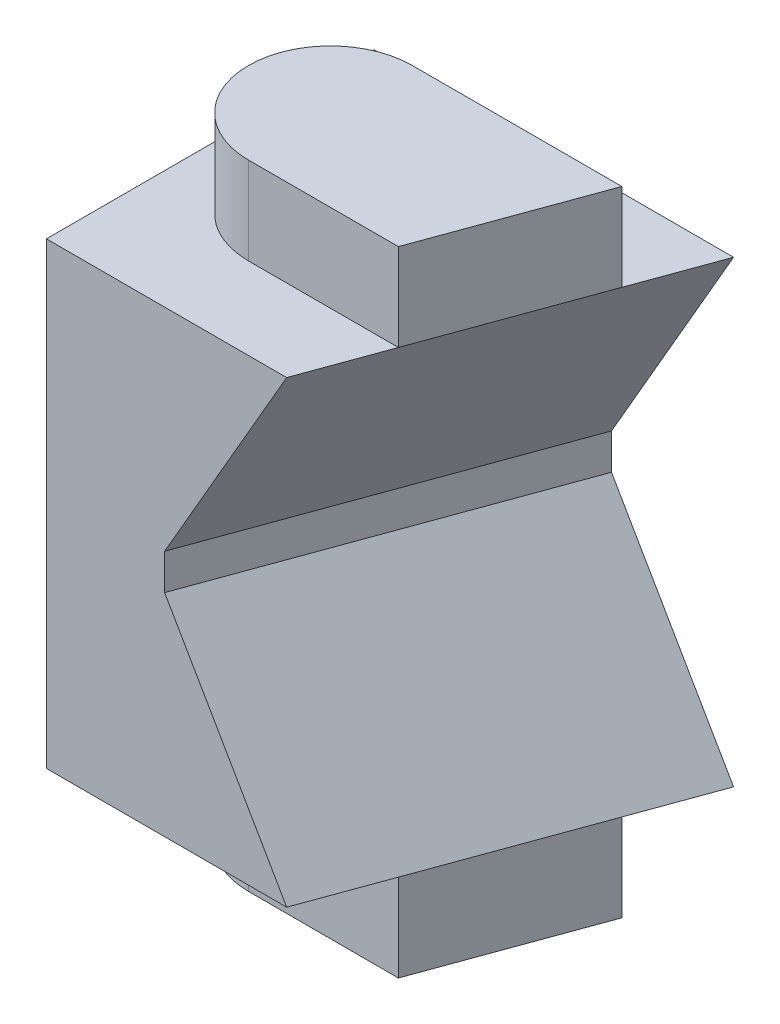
ISO-10303-21;
HEADER;
FILE_DESCRIPTION(('STEP AP214'),'2;1');
FILE_NAME('part.step','',(''),(''),'','','');
FILE_SCHEMA(('AUTOMOTIVE_DESIGN { 1 0 10303 214 1 1 1 1 }'));
ENDSEC;
DATA;
#1=APPLICATION_CONTEXT('core data for automotive mechanical design processes');
#2=APPLICATION_PROTOCOL_DEFINITION('international standard','automotive_design',2000,#1);
#3=PRODUCT_CONTEXT('',#1,'mechanical');
#4=PRODUCT('Part','Part','',(#3));
#5=PRODUCT_RELATED_PRODUCT_CATEGORY('part','',(#4));
#6=PRODUCT_DEFINITION_FORMATION('','',#4);
#7=PRODUCT_DEFINITION_CONTEXT('part definition',#1,'design');
#8=PRODUCT_DEFINITION('design','',#6,#7);
#9=PRODUCT_DEFINITION_SHAPE('','',#8);
#10=(LENGTH_UNIT() NAMED_UNIT(*) SI_UNIT(.MILLI.,.METRE.));
#11=(NAMED_UNIT(*) PLANE_ANGLE_UNIT() SI_UNIT($,.RADIAN.));
#12=(NAMED_UNIT(*) SI_UNIT($,.STERADIAN.) SOLID_ANGLE_UNIT());
#13=UNCERTAINTY_MEASURE_WITH_UNIT(LENGTH_MEASURE(1.E-05),#10,'distance_accuracy_value','');
#14=(GEOMETRIC_REPRESENTATION_CONTEXT(3) GLOBAL_UNCERTAINTY_ASSIGNED_CONTEXT((#13)) GLOBAL_UNIT_ASSIGNED_CONTEXT((#10,
#11,#12)) REPRESENTATION_CONTEXT('',''));
#15=CARTESIAN_POINT('',(0.,0.,0.));
#16=DIRECTION('',(0.,0.,1.));
#17=DIRECTION('',(1.,0.,0.));
#18=AXIS2_PLACEMENT_3D('',#15,#16,#17);
#19=CARTESIAN_POINT('',(0.,10.5,0.));
#20=DIRECTION('',(0.,0.,-1.));
#21=DIRECTION('',(-1.,0.,0.));
#22=AXIS2_PLACEMENT_3D('',#19,#20,#21);
#23=PLANE('',#22);
#24=DIRECTION('',(0.,1.,0.));
#25=VECTOR('',#24,1.);
#26=CARTESIAN_POINT('',(10.8708029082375,-0.82,0.));
#27=LINE('',#26,#25);
#28=CARTESIAN_POINT('',(10.8708029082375,-0.82,0.));
#29=VERTEX_POINT('',#28);
#30=CARTESIAN_POINT('',(10.8708029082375,0.82,0.));
#31=VERTEX_POINT('',#30);
#32=EDGE_CURVE('E174',#29,#31,#27,.T.);
#33=ORIENTED_EDGE('',*,*,#32,.F.);
#34=DIRECTION('',(-0.5,0.866025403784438,0.));
#35=VECTOR('',#34,1.);
#36=CARTESIAN_POINT('',(18.8524784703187,-14.6446676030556,0.));
#37=LINE('',#36,#35);
#38=CARTESIAN_POINT('',(16.4595535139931,-10.5,0.));
#39=VERTEX_POINT('',#38);
#40=EDGE_CURVE('E171',#39,#29,#37,.T.);
#41=ORIENTED_EDGE('',*,*,#40,.F.);
#42=DIRECTION('',(1.,0.,0.));
#43=VECTOR('',#42,1.);
#44=CARTESIAN_POINT('',(0.,-10.5,0.));
#45=LINE('',#44,#43);
#46=CARTESIAN_POINT('',(0.,-10.5,0.));
#47=VERTEX_POINT('',#46);
#48=EDGE_CURVE('E191',#47,#39,#45,.T.);
#49=ORIENTED_EDGE('',*,*,#48,.F.);
#50=DIRECTION('',(0.,-1.,0.));
#51=VECTOR('',#50,1.);
#52=CARTESIAN_POINT('',(0.,10.5,0.));
#53=LINE('',#52,#51);
#54=CARTESIAN_POINT('',(0.,10.5,0.));
#55=VERTEX_POINT('',#54);
#56=EDGE_CURVE('E9',#55,#47,#53,.T.);
#57=ORIENTED_EDGE('',*,*,#56,.F.);
#58=DIRECTION('',(1.,0.,0.));
#59=VECTOR('',#58,1.);
#60=CARTESIAN_POINT('',(0.,10.5,0.));
#61=LINE('',#60,#59);
#62=CARTESIAN_POINT('',(16.4595535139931,10.5,0.));
#63=VERTEX_POINT('',#62);
#64=EDGE_CURVE('E203',#55,#63,#61,.T.);
#65=ORIENTED_EDGE('',*,*,#64,.T.);
#66=DIRECTION('',(-0.5,-0.866025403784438,0.));
#67=VECTOR('',#66,1.);
#68=CARTESIAN_POINT('',(18.8524784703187,14.6446676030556,0.));
#69=LINE('',#68,#67);
#70=EDGE_CURVE('E176',#63,#31,#69,.T.);
#71=ORIENTED_EDGE('',*,*,#70,.T.);
#72=EDGE_LOOP('',(#33,#41,#49,#57,#65,#71));
#73=FACE_BOUND('',#72,.T.);
#74=ADVANCED_FACE('F14',(#73),#23,.T.);
#75=CARTESIAN_POINT('',(11.,10.5,15.));
#76=DIRECTION('',(0.,0.,1.));
#77=DIRECTION('',(1.,0.,0.));
#78=AXIS2_PLACEMENT_3D('',#75,#76,#77);
#79=PLANE('',#78);
#80=DIRECTION('',(-1.,0.,0.));
#81=VECTOR('',#80,1.);
#82=CARTESIAN_POINT('',(11.,-10.5,15.));
#83=LINE('',#82,#81);
#84=CARTESIAN_POINT('',(11.,-10.5,15.));
#85=VERTEX_POINT('',#84);
#86=CARTESIAN_POINT('',(0.,-10.5,15.));
#87=VERTEX_POINT('',#86);
#88=EDGE_CURVE('E198',#85,#87,#83,.T.);
#89=ORIENTED_EDGE('',*,*,#88,.F.);
#90=DIRECTION('',(-0.5,0.866025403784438,0.));
#91=VECTOR('',#90,1.);
#92=CARTESIAN_POINT('',(11.,-10.5,15.));
#93=LINE('',#92,#91);
#94=CARTESIAN_POINT('',(5.4112493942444,-0.82,15.));
#95=VERTEX_POINT('',#94);
#96=EDGE_CURVE('E169',#85,#95,#93,.T.);
#97=ORIENTED_EDGE('',*,*,#96,.T.);
#98=DIRECTION('',(0.,1.,0.));
#99=VECTOR('',#98,1.);
#100=CARTESIAN_POINT('',(5.4112493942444,-0.82,15.));
#101=LINE('',#100,#99);
#102=CARTESIAN_POINT('',(5.4112493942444,0.82,15.));
#103=VERTEX_POINT('',#102);
#104=EDGE_CURVE('E184',#95,#103,#101,.T.);
#105=ORIENTED_EDGE('',*,*,#104,.T.);
#106=DIRECTION('',(-0.5,-0.866025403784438,0.));
#107=VECTOR('',#106,1.);
#108=CARTESIAN_POINT('',(11.,10.5,15.));
#109=LINE('',#108,#107);
#110=CARTESIAN_POINT('',(11.,10.5,15.));
#111=VERTEX_POINT('',#110);
#112=EDGE_CURVE('E180',#111,#103,#109,.T.);
#113=ORIENTED_EDGE('',*,*,#112,.F.);
#114=DIRECTION('',(-1.,0.,0.));
#115=VECTOR('',#114,1.);
#116=CARTESIAN_POINT('',(11.,10.5,15.));
#117=LINE('',#116,#115);
#118=CARTESIAN_POINT('',(0.,10.5,15.));
#119=VERTEX_POINT('',#118);
#120=EDGE_CURVE('E209',#111,#119,#117,.T.);
#121=ORIENTED_EDGE('',*,*,#120,.T.);
#122=DIRECTION('',(0.,-1.,0.));
#123=VECTOR('',#122,1.);
#124=CARTESIAN_POINT('',(0.,10.5,15.));
#125=LINE('',#124,#123);
#126=EDGE_CURVE('E22',#119,#87,#125,.T.);
#127=ORIENTED_EDGE('',*,*,#126,.T.);
#128=EDGE_LOOP('',(#89,#97,#105,#113,#121,#127));
#129=FACE_BOUND('',#128,.T.);
#130=ADVANCED_FACE('F250',(#129),#79,.T.);
#131=CARTESIAN_POINT('',(11.,-10.5,15.));
#132=DIRECTION('',(0.,-1.,0.));
#133=DIRECTION('',(0.,0.,-1.));
#134=AXIS2_PLACEMENT_3D('',#131,#132,#133);
#135=PLANE('',#134);
#136=DIRECTION('',(-1.,0.,0.));
#137=VECTOR('',#136,1.);
#138=CARTESIAN_POINT('',(5.5,-10.5,11.25));
#139=LINE('',#138,#137);
#140=CARTESIAN_POINT('',(12.3648883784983,-10.5,11.25));
#141=VERTEX_POINT('',#140);
#142=CARTESIAN_POINT('',(5.5,-10.5,11.25));
#143=VERTEX_POINT('',#142);
#144=EDGE_CURVE('E151',#141,#143,#139,.T.);
#145=ORIENTED_EDGE('',*,*,#144,.F.);
#146=DIRECTION('',(-0.342020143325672,0.,0.939692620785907));
#147=VECTOR('',#146,1.);
#148=CARTESIAN_POINT('',(16.4595535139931,-10.5,0.));
#149=LINE('',#148,#147);
#150=EDGE_CURVE('E173',#141,#85,#149,.T.);
#151=ORIENTED_EDGE('',*,*,#150,.T.);
#152=ORIENTED_EDGE('',*,*,#88,.T.);
#153=DIRECTION('',(0.,0.,-1.));
#154=VECTOR('',#153,1.);
#155=CARTESIAN_POINT('',(0.,-10.5,15.));
#156=LINE('',#155,#154);
#157=EDGE_CURVE('E195',#87,#47,#156,.T.);
#158=ORIENTED_EDGE('',*,*,#157,.T.);
#159=ORIENTED_EDGE('',*,*,#48,.T.);
#160=CARTESIAN_POINT('',(15.0946651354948,-10.5,3.75));
#161=VERTEX_POINT('',#160);
#162=EDGE_CURVE('E201',#39,#161,#149,.T.);
#163=ORIENTED_EDGE('',*,*,#162,.T.);
#164=DIRECTION('',(1.,0.,0.));
#165=VECTOR('',#164,1.);
#166=CARTESIAN_POINT('',(5.5,-10.5,3.75));
#167=LINE('',#166,#165);
#168=CARTESIAN_POINT('',(5.5,-10.5,3.75));
#169=VERTEX_POINT('',#168);
#170=EDGE_CURVE('E159',#169,#161,#167,.T.);
#171=ORIENTED_EDGE('',*,*,#170,.F.);
#172=CARTESIAN_POINT('',(5.5,-10.5,7.5));
#173=DIRECTION('',(0.,-1.,0.));
#174=DIRECTION('',(0.,0.,-1.));
#175=AXIS2_PLACEMENT_3D('',#172,#173,#174);
#176=CIRCLE('',#175,3.75);
#177=EDGE_CURVE('E38',#143,#169,#176,.T.);
#178=ORIENTED_EDGE('',*,*,#177,.F.);
#179=EDGE_LOOP('',(#145,#151,#152,#158,#159,#163,#171,#178));
#180=FACE_BOUND('',#179,.T.);
#181=ADVANCED_FACE('F256',(#180),#135,.T.);
#182=CARTESIAN_POINT('',(0.,10.5,15.));
#183=DIRECTION('',(-1.,0.,0.));
#184=DIRECTION('',(0.,0.,1.));
#185=AXIS2_PLACEMENT_3D('',#182,#183,#184);
#186=PLANE('',#185);
#187=ORIENTED_EDGE('',*,*,#126,.F.);
#188=DIRECTION('',(0.,0.,-1.));
#189=VECTOR('',#188,1.);
#190=CARTESIAN_POINT('',(0.,10.5,15.));
#191=LINE('',#190,#189);
#192=EDGE_CURVE('E206',#119,#55,#191,.T.);
#193=ORIENTED_EDGE('',*,*,#192,.T.);
#194=ORIENTED_EDGE('',*,*,#56,.T.);
#195=ORIENTED_EDGE('',*,*,#157,.F.);
#196=EDGE_LOOP('',(#187,#193,#194,#195));
#197=FACE_BOUND('',#196,.T.);
#198=ADVANCED_FACE('F277',(#197),#186,.T.);
#199=CARTESIAN_POINT('',(11.,10.5,15.));
#200=DIRECTION('',(0.,-1.,0.));
#201=DIRECTION('',(0.,0.,-1.));
#202=AXIS2_PLACEMENT_3D('',#199,#200,#201);
#203=PLANE('',#202);
#204=CARTESIAN_POINT('',(5.5,10.5,7.5));
#205=DIRECTION('',(0.,-1.,0.));
#206=DIRECTION('',(0.,0.,-1.));
#207=AXIS2_PLACEMENT_3D('',#204,#205,#206);
#208=CIRCLE('',#207,3.75);
#209=CARTESIAN_POINT('',(5.5,10.5,11.25));
#210=VERTEX_POINT('',#209);
#211=CARTESIAN_POINT('',(5.5,10.5,3.75));
#212=VERTEX_POINT('',#211);
#213=EDGE_CURVE('E30',#210,#212,#208,.T.);
#214=ORIENTED_EDGE('',*,*,#213,.T.);
#215=DIRECTION('',(1.,0.,0.));
#216=VECTOR('',#215,1.);
#217=CARTESIAN_POINT('',(5.5,10.5,3.75));
#218=LINE('',#217,#216);
#219=CARTESIAN_POINT('',(15.0946651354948,10.5,3.75));
#220=VERTEX_POINT('',#219);
#221=EDGE_CURVE('E132',#212,#220,#218,.T.);
#222=ORIENTED_EDGE('',*,*,#221,.T.);
#223=DIRECTION('',(-0.342020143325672,0.,0.939692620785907));
#224=VECTOR('',#223,1.);
#225=CARTESIAN_POINT('',(16.4595535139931,10.5,0.));
#226=LINE('',#225,#224);
#227=EDGE_CURVE('E212',#63,#220,#226,.T.);
#228=ORIENTED_EDGE('',*,*,#227,.F.);
#229=ORIENTED_EDGE('',*,*,#64,.F.);
#230=ORIENTED_EDGE('',*,*,#192,.F.);
#231=ORIENTED_EDGE('',*,*,#120,.F.);
#232=CARTESIAN_POINT('',(12.3648883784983,10.5,11.25));
#233=VERTEX_POINT('',#232);
#234=EDGE_CURVE('E194',#233,#111,#226,.T.);
#235=ORIENTED_EDGE('',*,*,#234,.F.);
#236=DIRECTION('',(-1.,0.,0.));
#237=VECTOR('',#236,1.);
#238=CARTESIAN_POINT('',(5.5,10.5,11.25));
#239=LINE('',#238,#237);
#240=EDGE_CURVE('E142',#233,#210,#239,.T.);
#241=ORIENTED_EDGE('',*,*,#240,.T.);
#242=EDGE_LOOP('',(#214,#222,#228,#229,#230,#231,#235,#241));
#243=FACE_BOUND('',#242,.T.);
#244=ADVANCED_FACE('F235',(#243),#203,.F.);
#245=CARTESIAN_POINT('',(26.0312533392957,-10.5,-26.2980291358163));
#246=DIRECTION('',(0.825964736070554,0.476870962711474,0.300626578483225));
#247=DIRECTION('',(-0.5,0.866025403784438,0.));
#248=AXIS2_PLACEMENT_3D('',#245,#246,#247);
#249=PLANE('',#248);
#250=ORIENTED_EDGE('',*,*,#40,.T.);
#251=DIRECTION('',(-0.342020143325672,0.,0.939692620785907));
#252=VECTOR('',#251,1.);
#253=CARTESIAN_POINT('',(20.4425027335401,-0.82,-26.2980291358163));
#254=LINE('',#253,#252);
#255=EDGE_CURVE('E179',#29,#95,#254,.T.);
#256=ORIENTED_EDGE('',*,*,#255,.T.);
#257=ORIENTED_EDGE('',*,*,#96,.F.);
#258=ORIENTED_EDGE('',*,*,#150,.F.);
#259=DIRECTION('',(-0.342020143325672,0.,0.939692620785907));
#260=VECTOR('',#259,1.);
#261=CARTESIAN_POINT('',(15.0946651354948,-10.5,3.75));
#262=LINE('',#261,#260);
#263=EDGE_CURVE('E162',#161,#141,#262,.T.);
#264=ORIENTED_EDGE('',*,*,#263,.F.);
#265=ORIENTED_EDGE('',*,*,#162,.F.);
#266=EDGE_LOOP('',(#250,#256,#257,#258,#264,#265));
#267=FACE_BOUND('',#266,.T.);
#268=ADVANCED_FACE('F272',(#267),#249,.T.);
#269=CARTESIAN_POINT('',(20.4425027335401,-0.82,-26.2980291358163));
#270=DIRECTION('',(0.939692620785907,0.,0.342020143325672));
#271=DIRECTION('',(0.342020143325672,0.,-0.939692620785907));
#272=AXIS2_PLACEMENT_3D('',#269,#270,#271);
#273=PLANE('',#272);
#274=ORIENTED_EDGE('',*,*,#32,.T.);
#275=DIRECTION('',(-0.342020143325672,0.,0.939692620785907));
#276=VECTOR('',#275,1.);
#277=CARTESIAN_POINT('',(20.4425027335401,0.82,-26.2980291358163));
#278=LINE('',#277,#276);
#279=EDGE_CURVE('E183',#31,#103,#278,.T.);
#280=ORIENTED_EDGE('',*,*,#279,.T.);
#281=ORIENTED_EDGE('',*,*,#104,.F.);
#282=ORIENTED_EDGE('',*,*,#255,.F.);
#283=EDGE_LOOP('',(#274,#280,#281,#282));
#284=FACE_BOUND('',#283,.T.);
#285=ADVANCED_FACE('F265',(#284),#273,.T.);
#286=CARTESIAN_POINT('',(26.0312533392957,10.5,-26.2980291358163));
#287=DIRECTION('',(-0.825964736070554,0.476870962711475,-0.300626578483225));
#288=DIRECTION('',(-0.5,-0.866025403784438,0.));
#289=AXIS2_PLACEMENT_3D('',#286,#287,#288);
#290=PLANE('',#289);
#291=ORIENTED_EDGE('',*,*,#227,.T.);
#292=DIRECTION('',(-0.342020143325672,0.,0.939692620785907));
#293=VECTOR('',#292,1.);
#294=CARTESIAN_POINT('',(15.0946651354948,10.5,3.75));
#295=LINE('',#294,#293);
#296=EDGE_CURVE('E145',#220,#233,#295,.T.);
#297=ORIENTED_EDGE('',*,*,#296,.T.);
#298=ORIENTED_EDGE('',*,*,#234,.T.);
#299=ORIENTED_EDGE('',*,*,#112,.T.);
#300=ORIENTED_EDGE('',*,*,#279,.F.);
#301=ORIENTED_EDGE('',*,*,#70,.F.);
#302=EDGE_LOOP('',(#291,#297,#298,#299,#300,#301));
#303=FACE_BOUND('',#302,.T.);
#304=ADVANCED_FACE('F227',(#303),#290,.F.);
#305=CARTESIAN_POINT('',(5.5,-14.5,7.5));
#306=DIRECTION('',(0.,1.,0.));
#307=DIRECTION('',(0.,0.,1.));
#308=AXIS2_PLACEMENT_3D('',#305,#306,#307);
#309=CYLINDRICAL_SURFACE('',#308,3.75);
#310=ORIENTED_EDGE('',*,*,#177,.T.);
#311=DIRECTION('',(0.,1.,0.));
#312=VECTOR('',#311,1.);
#313=CARTESIAN_POINT('',(5.5,-14.5,3.75));
#314=LINE('',#313,#312);
#315=CARTESIAN_POINT('',(5.5,-14.5,3.75));
#316=VERTEX_POINT('',#315);
#317=EDGE_CURVE('E166',#316,#169,#314,.T.);
#318=ORIENTED_EDGE('',*,*,#317,.F.);
#319=CARTESIAN_POINT('',(5.5,-14.5,7.5));
#320=DIRECTION('',(0.,-1.,0.));
#321=DIRECTION('',(0.,0.,-1.));
#322=AXIS2_PLACEMENT_3D('',#319,#320,#321);
#323=CIRCLE('',#322,3.75);
#324=CARTESIAN_POINT('',(5.5,-14.5,11.25));
#325=VERTEX_POINT('',#324);
#326=EDGE_CURVE('E147',#325,#316,#323,.T.);
#327=ORIENTED_EDGE('',*,*,#326,.F.);
#328=DIRECTION('',(0.,1.,0.));
#329=VECTOR('',#328,1.);
#330=CARTESIAN_POINT('',(5.5,-14.5,11.25));
#331=LINE('',#330,#329);
#332=EDGE_CURVE('E157',#325,#143,#331,.T.);
#333=ORIENTED_EDGE('',*,*,#332,.T.);
#334=EDGE_LOOP('',(#310,#318,#327,#333));
#335=FACE_BOUND('',#334,.T.);
#336=ADVANCED_FACE('F285',(#335),#309,.T.);
#337=CARTESIAN_POINT('',(5.5,-14.5,3.75));
#338=DIRECTION('',(0.,0.,1.));
#339=DIRECTION('',(1.,0.,0.));
#340=AXIS2_PLACEMENT_3D('',#337,#338,#339);
#341=PLANE('',#340);
#342=ORIENTED_EDGE('',*,*,#170,.T.);
#343=DIRECTION('',(0.,1.,0.));
#344=VECTOR('',#343,1.);
#345=CARTESIAN_POINT('',(15.0946651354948,-14.5,3.75));
#346=LINE('',#345,#344);
#347=CARTESIAN_POINT('',(15.0946651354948,-14.5,3.75));
#348=VERTEX_POINT('',#347);
#349=EDGE_CURVE('E170',#348,#161,#346,.T.);
#350=ORIENTED_EDGE('',*,*,#349,.F.);
#351=DIRECTION('',(1.,0.,0.));
#352=VECTOR('',#351,1.);
#353=CARTESIAN_POINT('',(5.5,-14.5,3.75));
#354=LINE('',#353,#352);
#355=EDGE_CURVE('E150',#316,#348,#354,.T.);
#356=ORIENTED_EDGE('',*,*,#355,.F.);
#357=ORIENTED_EDGE('',*,*,#317,.T.);
#358=EDGE_LOOP('',(#342,#350,#356,#357));
#359=FACE_BOUND('',#358,.T.);
#360=ADVANCED_FACE('F294',(#359),#341,.F.);
#361=CARTESIAN_POINT('',(15.0946651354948,-14.5,3.75));
#362=DIRECTION('',(-0.939692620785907,0.,-0.342020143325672));
#363=DIRECTION('',(-0.342020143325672,0.,0.939692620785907));
#364=AXIS2_PLACEMENT_3D('',#361,#362,#363);
#365=PLANE('',#364);
#366=ORIENTED_EDGE('',*,*,#263,.T.);
#367=DIRECTION('',(0.,1.,0.));
#368=VECTOR('',#367,1.);
#369=CARTESIAN_POINT('',(12.3648883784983,-14.5,11.25));
#370=LINE('',#369,#368);
#371=CARTESIAN_POINT('',(12.3648883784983,-14.5,11.25));
#372=VERTEX_POINT('',#371);
#373=EDGE_CURVE('E165',#372,#141,#370,.T.);
#374=ORIENTED_EDGE('',*,*,#373,.F.);
#375=DIRECTION('',(-0.342020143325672,0.,0.939692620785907));
#376=VECTOR('',#375,1.);
#377=CARTESIAN_POINT('',(15.0946651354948,-14.5,3.75));
#378=LINE('',#377,#376);
#379=EDGE_CURVE('E153',#348,#372,#378,.T.);
#380=ORIENTED_EDGE('',*,*,#379,.F.);
#381=ORIENTED_EDGE('',*,*,#349,.T.);
#382=EDGE_LOOP('',(#366,#374,#380,#381));
#383=FACE_BOUND('',#382,.T.);
#384=ADVANCED_FACE('F292',(#383),#365,.F.);
#385=CARTESIAN_POINT('',(5.5,-14.5,11.25));
#386=DIRECTION('',(0.,0.,-1.));
#387=DIRECTION('',(-1.,0.,0.));
#388=AXIS2_PLACEMENT_3D('',#385,#386,#387);
#389=PLANE('',#388);
#390=ORIENTED_EDGE('',*,*,#144,.T.);
#391=ORIENTED_EDGE('',*,*,#332,.F.);
#392=DIRECTION('',(-1.,0.,0.));
#393=VECTOR('',#392,1.);
#394=CARTESIAN_POINT('',(5.5,-14.5,11.25));
#395=LINE('',#394,#393);
#396=EDGE_CURVE('E155',#372,#325,#395,.T.);
#397=ORIENTED_EDGE('',*,*,#396,.F.);
#398=ORIENTED_EDGE('',*,*,#373,.T.);
#399=EDGE_LOOP('',(#390,#391,#397,#398));
#400=FACE_BOUND('',#399,.T.);
#401=ADVANCED_FACE('F280',(#400),#389,.F.);
#402=CARTESIAN_POINT('',(5.5,-14.5,7.5));
#403=DIRECTION('',(0.,-1.,0.));
#404=DIRECTION('',(0.,0.,-1.));
#405=AXIS2_PLACEMENT_3D('',#402,#403,#404);
#406=PLANE('',#405);
#407=ORIENTED_EDGE('',*,*,#326,.T.);
#408=ORIENTED_EDGE('',*,*,#355,.T.);
#409=ORIENTED_EDGE('',*,*,#379,.T.);
#410=ORIENTED_EDGE('',*,*,#396,.T.);
#411=EDGE_LOOP('',(#407,#408,#409,#410));
#412=FACE_BOUND('',#411,.T.);
#413=ADVANCED_FACE('F288',(#412),#406,.T.);
#414=CARTESIAN_POINT('',(5.5,14.5,7.5));
#415=DIRECTION('',(0.,-1.,0.));
#416=DIRECTION('',(0.,0.,-1.));
#417=AXIS2_PLACEMENT_3D('',#414,#415,#416);
#418=CYLINDRICAL_SURFACE('',#417,3.75);
#419=ORIENTED_EDGE('',*,*,#213,.F.);
#420=DIRECTION('',(0.,-1.,0.));
#421=VECTOR('',#420,1.);
#422=CARTESIAN_POINT('',(5.5,14.5,11.25));
#423=LINE('',#422,#421);
#424=CARTESIAN_POINT('',(5.5,14.5,11.25));
#425=VERTEX_POINT('',#424);
#426=EDGE_CURVE('E113',#425,#210,#423,.T.);
#427=ORIENTED_EDGE('',*,*,#426,.F.);
#428=CARTESIAN_POINT('',(5.5,14.5,7.5));
#429=DIRECTION('',(0.,-1.,0.));
#430=DIRECTION('',(0.,0.,-1.));
#431=AXIS2_PLACEMENT_3D('',#428,#429,#430);
#432=CIRCLE('',#431,3.75);
#433=CARTESIAN_POINT('',(5.5,14.5,3.75));
#434=VERTEX_POINT('',#433);
#435=EDGE_CURVE('E116',#425,#434,#432,.T.);
#436=ORIENTED_EDGE('',*,*,#435,.T.);
#437=DIRECTION('',(0.,-1.,0.));
#438=VECTOR('',#437,1.);
#439=CARTESIAN_POINT('',(5.5,14.5,3.75));
#440=LINE('',#439,#438);
#441=EDGE_CURVE('E140',#434,#212,#440,.T.);
#442=ORIENTED_EDGE('',*,*,#441,.T.);
#443=EDGE_LOOP('',(#419,#427,#436,#442));
#444=FACE_BOUND('',#443,.T.);
#445=ADVANCED_FACE('F115',(#444),#418,.T.);
#446=CARTESIAN_POINT('',(5.5,14.5,11.25));
#447=DIRECTION('',(0.,0.,1.));
#448=DIRECTION('',(1.,0.,0.));
#449=AXIS2_PLACEMENT_3D('',#446,#447,#448);
#450=PLANE('',#449);
#451=ORIENTED_EDGE('',*,*,#240,.F.);
#452=DIRECTION('',(0.,-1.,0.));
#453=VECTOR('',#452,1.);
#454=CARTESIAN_POINT('',(12.3648883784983,14.5,11.25));
#455=LINE('',#454,#453);
#456=CARTESIAN_POINT('',(12.3648883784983,14.5,11.25));
#457=VERTEX_POINT('',#456);
#458=EDGE_CURVE('E122',#457,#233,#455,.T.);
#459=ORIENTED_EDGE('',*,*,#458,.F.);
#460=DIRECTION('',(-1.,0.,0.));
#461=VECTOR('',#460,1.);
#462=CARTESIAN_POINT('',(5.5,14.5,11.25));
#463=LINE('',#462,#461);
#464=EDGE_CURVE('E128',#457,#425,#463,.T.);
#465=ORIENTED_EDGE('',*,*,#464,.T.);
#466=ORIENTED_EDGE('',*,*,#426,.T.);
#467=EDGE_LOOP('',(#451,#459,#465,#466));
#468=FACE_BOUND('',#467,.T.);
#469=ADVANCED_FACE('F134',(#468),#450,.T.);
#470=CARTESIAN_POINT('',(15.0946651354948,14.5,3.75));
#471=DIRECTION('',(0.939692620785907,0.,0.342020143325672));
#472=DIRECTION('',(0.342020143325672,0.,-0.939692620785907));
#473=AXIS2_PLACEMENT_3D('',#470,#471,#472);
#474=PLANE('',#473);
#475=ORIENTED_EDGE('',*,*,#296,.F.);
#476=DIRECTION('',(0.,-1.,0.));
#477=VECTOR('',#476,1.);
#478=CARTESIAN_POINT('',(15.0946651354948,14.5,3.75));
#479=LINE('',#478,#477);
#480=CARTESIAN_POINT('',(15.0946651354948,14.5,3.75));
#481=VERTEX_POINT('',#480);
#482=EDGE_CURVE('E17',#481,#220,#479,.T.);
#483=ORIENTED_EDGE('',*,*,#482,.F.);
#484=DIRECTION('',(-0.342020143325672,0.,0.939692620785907));
#485=VECTOR('',#484,1.);
#486=CARTESIAN_POINT('',(15.0946651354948,14.5,3.75));
#487=LINE('',#486,#485);
#488=EDGE_CURVE('E135',#481,#457,#487,.T.);
#489=ORIENTED_EDGE('',*,*,#488,.T.);
#490=ORIENTED_EDGE('',*,*,#458,.T.);
#491=EDGE_LOOP('',(#475,#483,#489,#490));
#492=FACE_BOUND('',#491,.T.);
#493=ADVANCED_FACE('F232',(#492),#474,.T.);
#494=CARTESIAN_POINT('',(5.5,14.5,3.75));
#495=DIRECTION('',(0.,0.,-1.));
#496=DIRECTION('',(-1.,0.,0.));
#497=AXIS2_PLACEMENT_3D('',#494,#495,#496);
#498=PLANE('',#497);
#499=ORIENTED_EDGE('',*,*,#221,.F.);
#500=ORIENTED_EDGE('',*,*,#441,.F.);
#501=DIRECTION('',(1.,0.,0.));
#502=VECTOR('',#501,1.);
#503=CARTESIAN_POINT('',(5.5,14.5,3.75));
#504=LINE('',#503,#502);
#505=EDGE_CURVE('E131',#434,#481,#504,.T.);
#506=ORIENTED_EDGE('',*,*,#505,.T.);
#507=ORIENTED_EDGE('',*,*,#482,.T.);
#508=EDGE_LOOP('',(#499,#500,#506,#507));
#509=FACE_BOUND('',#508,.T.);
#510=ADVANCED_FACE('F238',(#509),#498,.T.);
#511=CARTESIAN_POINT('',(5.5,14.5,7.5));
#512=DIRECTION('',(0.,1.,0.));
#513=DIRECTION('',(0.,0.,-1.));
#514=AXIS2_PLACEMENT_3D('',#511,#512,#513);
#515=PLANE('',#514);
#516=ORIENTED_EDGE('',*,*,#435,.F.);
#517=ORIENTED_EDGE('',*,*,#464,.F.);
#518=ORIENTED_EDGE('',*,*,#488,.F.);
#519=ORIENTED_EDGE('',*,*,#505,.F.);
#520=EDGE_LOOP('',(#516,#517,#518,#519));
#521=FACE_BOUND('',#520,.T.);
#522=ADVANCED_FACE('F126',(#521),#515,.T.);
#523=CLOSED_SHELL('',(#74,#130,#181,#198,#244,#268,#285,#304,#336,#360,#384,#401,#413,#445,#469,
#493,#510,#522));
#524=MANIFOLD_SOLID_BREP('B1',#523);
#525=ADVANCED_BREP_SHAPE_REPRESENTATION('',(#18,#524),#14);
#526=SHAPE_DEFINITION_REPRESENTATION(#9,#525);
ENDSEC;
END-ISO-10303-21;
